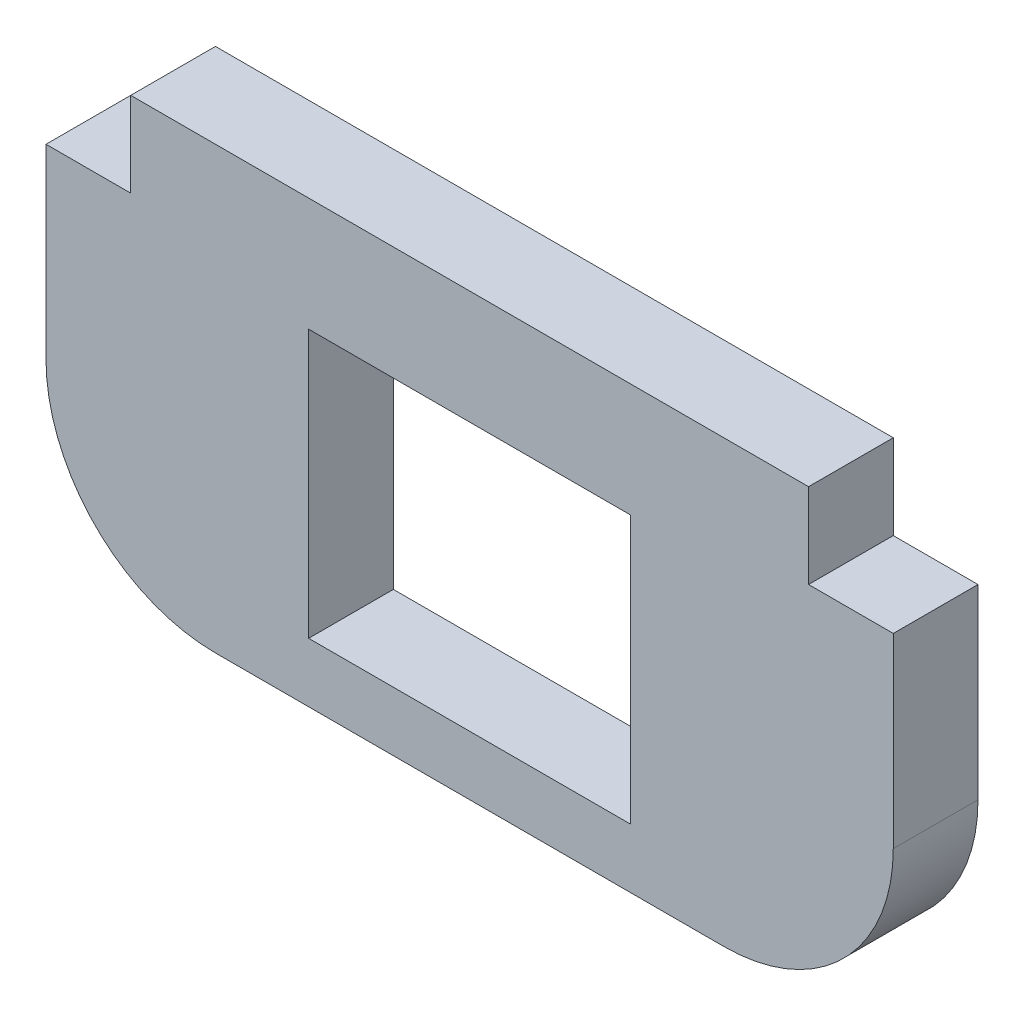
ISO-10303-21;
HEADER;
FILE_DESCRIPTION(('STEP AP214'),'2;1');
FILE_NAME('part.step','',(''),(''),'','','');
FILE_SCHEMA(('AUTOMOTIVE_DESIGN { 1 0 10303 214 1 1 1 1 }'));
ENDSEC;
DATA;
#1=APPLICATION_CONTEXT('core data for automotive mechanical design processes');
#2=APPLICATION_PROTOCOL_DEFINITION('international standard','automotive_design',2000,#1);
#3=PRODUCT_CONTEXT('',#1,'mechanical');
#4=PRODUCT('Part','Part','',(#3));
#5=PRODUCT_RELATED_PRODUCT_CATEGORY('part','',(#4));
#6=PRODUCT_DEFINITION_FORMATION('','',#4);
#7=PRODUCT_DEFINITION_CONTEXT('part definition',#1,'design');
#8=PRODUCT_DEFINITION('design','',#6,#7);
#9=PRODUCT_DEFINITION_SHAPE('','',#8);
#10=(LENGTH_UNIT() NAMED_UNIT(*) SI_UNIT(.MILLI.,.METRE.));
#11=(NAMED_UNIT(*) PLANE_ANGLE_UNIT() SI_UNIT($,.RADIAN.));
#12=(NAMED_UNIT(*) SI_UNIT($,.STERADIAN.) SOLID_ANGLE_UNIT());
#13=UNCERTAINTY_MEASURE_WITH_UNIT(LENGTH_MEASURE(1.E-05),#10,'distance_accuracy_value','');
#14=(GEOMETRIC_REPRESENTATION_CONTEXT(3) GLOBAL_UNCERTAINTY_ASSIGNED_CONTEXT((#13)) GLOBAL_UNIT_ASSIGNED_CONTEXT((#10,
#11,#12)) REPRESENTATION_CONTEXT('',''));
#15=CARTESIAN_POINT('',(0.,0.,0.));
#16=DIRECTION('',(0.,0.,1.));
#17=DIRECTION('',(1.,0.,0.));
#18=AXIS2_PLACEMENT_3D('',#15,#16,#17);
#19=CARTESIAN_POINT('',(15.875,8.255,1.5875));
#20=DIRECTION('',(-1.,0.,0.));
#21=DIRECTION('',(0.,-1.,0.));
#22=AXIS2_PLACEMENT_3D('',#19,#20,#21);
#23=PLANE('',#22);
#24=DIRECTION('',(0.,1.,0.));
#25=VECTOR('',#24,1.);
#26=CARTESIAN_POINT('',(15.875,8.255,1.5875));
#27=LINE('',#26,#25);
#28=CARTESIAN_POINT('',(15.875,-1.905,1.5875));
#29=VERTEX_POINT('',#28);
#30=CARTESIAN_POINT('',(15.875,5.08,1.5875));
#31=VERTEX_POINT('',#30);
#32=EDGE_CURVE('E218',#29,#31,#27,.T.);
#33=ORIENTED_EDGE('',*,*,#32,.F.);
#34=DIRECTION('',(0.,0.,-1.));
#35=VECTOR('',#34,1.);
#36=CARTESIAN_POINT('',(15.875,-1.905,1.5875));
#37=LINE('',#36,#35);
#38=CARTESIAN_POINT('',(15.875,-1.905,-1.5875));
#39=VERTEX_POINT('',#38);
#40=EDGE_CURVE('E227',#29,#39,#37,.T.);
#41=ORIENTED_EDGE('',*,*,#40,.T.);
#42=DIRECTION('',(0.,1.,0.));
#43=VECTOR('',#42,1.);
#44=CARTESIAN_POINT('',(15.875,8.255,-1.5875));
#45=LINE('',#44,#43);
#46=CARTESIAN_POINT('',(15.875,5.08,-1.5875));
#47=VERTEX_POINT('',#46);
#48=EDGE_CURVE('E214',#39,#47,#45,.T.);
#49=ORIENTED_EDGE('',*,*,#48,.T.);
#50=DIRECTION('',(0.,0.,1.));
#51=VECTOR('',#50,1.);
#52=CARTESIAN_POINT('',(15.875,5.08,-1.5875));
#53=LINE('',#52,#51);
#54=EDGE_CURVE('E192',#47,#31,#53,.T.);
#55=ORIENTED_EDGE('',*,*,#54,.T.);
#56=EDGE_LOOP('',(#33,#41,#49,#55));
#57=FACE_BOUND('',#56,.T.);
#58=ADVANCED_FACE('F33',(#57),#23,.F.);
#59=CARTESIAN_POINT('',(-15.875,8.255,1.5875));
#60=DIRECTION('',(0.,-1.,0.));
#61=DIRECTION('',(0.,0.,-1.));
#62=AXIS2_PLACEMENT_3D('',#59,#60,#61);
#63=PLANE('',#62);
#64=DIRECTION('',(-1.,0.,0.));
#65=VECTOR('',#64,1.);
#66=CARTESIAN_POINT('',(-15.875,8.255,1.5875));
#67=LINE('',#66,#65);
#68=CARTESIAN_POINT('',(12.7,8.255,1.5875));
#69=VERTEX_POINT('',#68);
#70=CARTESIAN_POINT('',(-12.7,8.255,1.5875));
#71=VERTEX_POINT('',#70);
#72=EDGE_CURVE('E220',#69,#71,#67,.T.);
#73=ORIENTED_EDGE('',*,*,#72,.F.);
#74=DIRECTION('',(0.,0.,1.));
#75=VECTOR('',#74,1.);
#76=CARTESIAN_POINT('',(12.7,8.255,-1.5875));
#77=LINE('',#76,#75);
#78=CARTESIAN_POINT('',(12.7,8.255,-1.5875));
#79=VERTEX_POINT('',#78);
#80=EDGE_CURVE('E187',#79,#69,#77,.T.);
#81=ORIENTED_EDGE('',*,*,#80,.F.);
#82=DIRECTION('',(-1.,0.,0.));
#83=VECTOR('',#82,1.);
#84=CARTESIAN_POINT('',(-15.875,8.255,-1.5875));
#85=LINE('',#84,#83);
#86=CARTESIAN_POINT('',(-12.7,8.255,-1.5875));
#87=VERTEX_POINT('',#86);
#88=EDGE_CURVE('E229',#79,#87,#85,.T.);
#89=ORIENTED_EDGE('',*,*,#88,.T.);
#90=DIRECTION('',(0.,0.,1.));
#91=VECTOR('',#90,1.);
#92=CARTESIAN_POINT('',(-12.7,8.255,-1.5875));
#93=LINE('',#92,#91);
#94=EDGE_CURVE('E211',#87,#71,#93,.T.);
#95=ORIENTED_EDGE('',*,*,#94,.T.);
#96=EDGE_LOOP('',(#73,#81,#89,#95));
#97=FACE_BOUND('',#96,.T.);
#98=ADVANCED_FACE('F275',(#97),#63,.F.);
#99=CARTESIAN_POINT('',(-15.875,8.255,1.5875));
#100=DIRECTION('',(1.,0.,0.));
#101=DIRECTION('',(0.,0.,-1.));
#102=AXIS2_PLACEMENT_3D('',#99,#100,#101);
#103=PLANE('',#102);
#104=DIRECTION('',(0.,-1.,0.));
#105=VECTOR('',#104,1.);
#106=CARTESIAN_POINT('',(-15.875,8.255,-1.5875));
#107=LINE('',#106,#105);
#108=CARTESIAN_POINT('',(-15.875,5.08,-1.5875));
#109=VERTEX_POINT('',#108);
#110=CARTESIAN_POINT('',(-15.875,-1.905,-1.5875));
#111=VERTEX_POINT('',#110);
#112=EDGE_CURVE('E231',#109,#111,#107,.T.);
#113=ORIENTED_EDGE('',*,*,#112,.T.);
#114=DIRECTION('',(0.,0.,-1.));
#115=VECTOR('',#114,1.);
#116=CARTESIAN_POINT('',(-15.875,-1.905,1.5875));
#117=LINE('',#116,#115);
#118=CARTESIAN_POINT('',(-15.875,-1.905,1.5875));
#119=VERTEX_POINT('',#118);
#120=EDGE_CURVE('E11',#111,#119,#117,.F.);
#121=ORIENTED_EDGE('',*,*,#120,.T.);
#122=DIRECTION('',(0.,-1.,0.));
#123=VECTOR('',#122,1.);
#124=CARTESIAN_POINT('',(-15.875,8.255,1.5875));
#125=LINE('',#124,#123);
#126=CARTESIAN_POINT('',(-15.875,5.08,1.5875));
#127=VERTEX_POINT('',#126);
#128=EDGE_CURVE('E223',#127,#119,#125,.T.);
#129=ORIENTED_EDGE('',*,*,#128,.F.);
#130=DIRECTION('',(0.,0.,1.));
#131=VECTOR('',#130,1.);
#132=CARTESIAN_POINT('',(-15.875,5.08,-1.5875));
#133=LINE('',#132,#131);
#134=EDGE_CURVE('E206',#109,#127,#133,.T.);
#135=ORIENTED_EDGE('',*,*,#134,.F.);
#136=EDGE_LOOP('',(#113,#121,#129,#135));
#137=FACE_BOUND('',#136,.T.);
#138=ADVANCED_FACE('F263',(#137),#103,.F.);
#139=CARTESIAN_POINT('',(-15.875,-8.255,1.5875));
#140=DIRECTION('',(0.,1.,0.));
#141=DIRECTION('',(0.,0.,1.));
#142=AXIS2_PLACEMENT_3D('',#139,#140,#141);
#143=PLANE('',#142);
#144=DIRECTION('',(1.,0.,0.));
#145=VECTOR('',#144,1.);
#146=CARTESIAN_POINT('',(-15.875,-8.255,-1.5875));
#147=LINE('',#146,#145);
#148=CARTESIAN_POINT('',(-9.525,-8.255,-1.5875));
#149=VERTEX_POINT('',#148);
#150=CARTESIAN_POINT('',(9.52500000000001,-8.255,-1.5875));
#151=VERTEX_POINT('',#150);
#152=EDGE_CURVE('E221',#149,#151,#147,.T.);
#153=ORIENTED_EDGE('',*,*,#152,.T.);
#154=DIRECTION('',(0.,0.,-1.));
#155=VECTOR('',#154,1.);
#156=CARTESIAN_POINT('',(9.52500000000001,-8.255,1.5875));
#157=LINE('',#156,#155);
#158=CARTESIAN_POINT('',(9.52500000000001,-8.255,1.5875));
#159=VERTEX_POINT('',#158);
#160=EDGE_CURVE('E54',#151,#159,#157,.F.);
#161=ORIENTED_EDGE('',*,*,#160,.T.);
#162=DIRECTION('',(1.,0.,0.));
#163=VECTOR('',#162,1.);
#164=CARTESIAN_POINT('',(-15.875,-8.255,1.5875));
#165=LINE('',#164,#163);
#166=CARTESIAN_POINT('',(-9.525,-8.255,1.5875));
#167=VERTEX_POINT('',#166);
#168=EDGE_CURVE('E225',#167,#159,#165,.T.);
#169=ORIENTED_EDGE('',*,*,#168,.F.);
#170=DIRECTION('',(0.,0.,-1.));
#171=VECTOR('',#170,1.);
#172=CARTESIAN_POINT('',(-9.525,-8.255,1.5875));
#173=LINE('',#172,#171);
#174=EDGE_CURVE('E240',#167,#149,#173,.T.);
#175=ORIENTED_EDGE('',*,*,#174,.T.);
#176=EDGE_LOOP('',(#153,#161,#169,#175));
#177=FACE_BOUND('',#176,.T.);
#178=ADVANCED_FACE('F257',(#177),#143,.F.);
#179=CARTESIAN_POINT('',(15.875,-8.255,1.5875));
#180=DIRECTION('',(0.,0.,1.));
#181=DIRECTION('',(1.,0.,0.));
#182=AXIS2_PLACEMENT_3D('',#179,#180,#181);
#183=PLANE('',#182);
#184=DIRECTION('',(0.,1.,0.));
#185=VECTOR('',#184,1.);
#186=CARTESIAN_POINT('',(6.0325,4.0005,1.5875));
#187=LINE('',#186,#185);
#188=CARTESIAN_POINT('',(6.0325,-6.0325,1.5875));
#189=VERTEX_POINT('',#188);
#190=CARTESIAN_POINT('',(6.0325,4.0005,1.5875));
#191=VERTEX_POINT('',#190);
#192=EDGE_CURVE('E143',#189,#191,#187,.T.);
#193=ORIENTED_EDGE('',*,*,#192,.F.);
#194=DIRECTION('',(1.,0.,0.));
#195=VECTOR('',#194,1.);
#196=CARTESIAN_POINT('',(-6.0325,-6.0325,1.5875));
#197=LINE('',#196,#195);
#198=CARTESIAN_POINT('',(-6.0325,-6.0325,1.5875));
#199=VERTEX_POINT('',#198);
#200=EDGE_CURVE('E161',#199,#189,#197,.T.);
#201=ORIENTED_EDGE('',*,*,#200,.F.);
#202=DIRECTION('',(0.,-1.,0.));
#203=VECTOR('',#202,1.);
#204=CARTESIAN_POINT('',(-6.0325,4.0005,1.5875));
#205=LINE('',#204,#203);
#206=CARTESIAN_POINT('',(-6.0325,4.0005,1.5875));
#207=VERTEX_POINT('',#206);
#208=EDGE_CURVE('E164',#207,#199,#205,.T.);
#209=ORIENTED_EDGE('',*,*,#208,.F.);
#210=DIRECTION('',(-1.,0.,0.));
#211=VECTOR('',#210,1.);
#212=CARTESIAN_POINT('',(-6.0325,4.0005,1.5875));
#213=LINE('',#212,#211);
#214=EDGE_CURVE('E170',#191,#207,#213,.T.);
#215=ORIENTED_EDGE('',*,*,#214,.F.);
#216=EDGE_LOOP('',(#193,#201,#209,#215));
#217=FACE_BOUND('',#216,.T.);
#218=ORIENTED_EDGE('',*,*,#168,.T.);
#219=CARTESIAN_POINT('',(9.52500000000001,-1.905,1.5875));
#220=DIRECTION('',(0.,0.,1.));
#221=DIRECTION('',(1.,0.,0.));
#222=AXIS2_PLACEMENT_3D('',#219,#220,#221);
#223=CIRCLE('',#222,6.35);
#224=EDGE_CURVE('E41',#159,#29,#223,.T.);
#225=ORIENTED_EDGE('',*,*,#224,.T.);
#226=ORIENTED_EDGE('',*,*,#32,.T.);
#227=DIRECTION('',(1.,0.,0.));
#228=VECTOR('',#227,1.);
#229=CARTESIAN_POINT('',(15.875,5.08,1.5875));
#230=LINE('',#229,#228);
#231=CARTESIAN_POINT('',(12.7,5.08,1.5875));
#232=VERTEX_POINT('',#231);
#233=EDGE_CURVE('E184',#232,#31,#230,.T.);
#234=ORIENTED_EDGE('',*,*,#233,.F.);
#235=DIRECTION('',(0.,-1.,0.));
#236=VECTOR('',#235,1.);
#237=CARTESIAN_POINT('',(12.7,8.255,1.5875));
#238=LINE('',#237,#236);
#239=EDGE_CURVE('E176',#69,#232,#238,.T.);
#240=ORIENTED_EDGE('',*,*,#239,.F.);
#241=ORIENTED_EDGE('',*,*,#72,.T.);
#242=DIRECTION('',(0.,1.,0.));
#243=VECTOR('',#242,1.);
#244=CARTESIAN_POINT('',(-12.7,8.255,1.5875));
#245=LINE('',#244,#243);
#246=CARTESIAN_POINT('',(-12.7,5.08,1.5875));
#247=VERTEX_POINT('',#246);
#248=EDGE_CURVE('E203',#247,#71,#245,.T.);
#249=ORIENTED_EDGE('',*,*,#248,.F.);
#250=DIRECTION('',(1.,0.,0.));
#251=VECTOR('',#250,1.);
#252=CARTESIAN_POINT('',(-15.875,5.08,1.5875));
#253=LINE('',#252,#251);
#254=EDGE_CURVE('E195',#127,#247,#253,.T.);
#255=ORIENTED_EDGE('',*,*,#254,.F.);
#256=ORIENTED_EDGE('',*,*,#128,.T.);
#257=CARTESIAN_POINT('',(-9.525,-1.905,1.5875));
#258=DIRECTION('',(0.,0.,1.));
#259=DIRECTION('',(1.,0.,0.));
#260=AXIS2_PLACEMENT_3D('',#257,#258,#259);
#261=CIRCLE('',#260,6.35);
#262=EDGE_CURVE('E244',#119,#167,#261,.T.);
#263=ORIENTED_EDGE('',*,*,#262,.T.);
#264=EDGE_LOOP('',(#218,#225,#226,#234,#240,#241,#249,#255,#256,#263));
#265=FACE_BOUND('',#264,.T.);
#266=ADVANCED_FACE('F248',(#217,#265),#183,.T.);
#267=CARTESIAN_POINT('',(15.875,-8.255,-1.5875));
#268=DIRECTION('',(0.,0.,1.));
#269=DIRECTION('',(1.,0.,0.));
#270=AXIS2_PLACEMENT_3D('',#267,#268,#269);
#271=PLANE('',#270);
#272=DIRECTION('',(1.,0.,0.));
#273=VECTOR('',#272,1.);
#274=CARTESIAN_POINT('',(-6.0325,-6.0325,-1.5875));
#275=LINE('',#274,#273);
#276=CARTESIAN_POINT('',(-6.0325,-6.0325,-1.5875));
#277=VERTEX_POINT('',#276);
#278=CARTESIAN_POINT('',(6.0325,-6.0325,-1.5875));
#279=VERTEX_POINT('',#278);
#280=EDGE_CURVE('E148',#277,#279,#275,.T.);
#281=ORIENTED_EDGE('',*,*,#280,.T.);
#282=DIRECTION('',(0.,1.,0.));
#283=VECTOR('',#282,1.);
#284=CARTESIAN_POINT('',(6.0325,4.0005,-1.5875));
#285=LINE('',#284,#283);
#286=CARTESIAN_POINT('',(6.0325,4.0005,-1.5875));
#287=VERTEX_POINT('',#286);
#288=EDGE_CURVE('E140',#279,#287,#285,.T.);
#289=ORIENTED_EDGE('',*,*,#288,.T.);
#290=DIRECTION('',(-1.,0.,0.));
#291=VECTOR('',#290,1.);
#292=CARTESIAN_POINT('',(-6.0325,4.0005,-1.5875));
#293=LINE('',#292,#291);
#294=CARTESIAN_POINT('',(-6.0325,4.0005,-1.5875));
#295=VERTEX_POINT('',#294);
#296=EDGE_CURVE('E152',#287,#295,#293,.T.);
#297=ORIENTED_EDGE('',*,*,#296,.T.);
#298=DIRECTION('',(0.,-1.,0.));
#299=VECTOR('',#298,1.);
#300=CARTESIAN_POINT('',(-6.0325,4.0005,-1.5875));
#301=LINE('',#300,#299);
#302=EDGE_CURVE('E156',#295,#277,#301,.T.);
#303=ORIENTED_EDGE('',*,*,#302,.T.);
#304=EDGE_LOOP('',(#281,#289,#297,#303));
#305=FACE_BOUND('',#304,.T.);
#306=ORIENTED_EDGE('',*,*,#48,.F.);
#307=CARTESIAN_POINT('',(9.52500000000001,-1.905,-1.5875));
#308=DIRECTION('',(0.,0.,1.));
#309=DIRECTION('',(1.,0.,0.));
#310=AXIS2_PLACEMENT_3D('',#307,#308,#309);
#311=CIRCLE('',#310,6.35);
#312=EDGE_CURVE('E238',#39,#151,#311,.F.);
#313=ORIENTED_EDGE('',*,*,#312,.T.);
#314=ORIENTED_EDGE('',*,*,#152,.F.);
#315=CARTESIAN_POINT('',(-9.525,-1.905,-1.5875));
#316=DIRECTION('',(0.,0.,1.));
#317=DIRECTION('',(1.,0.,0.));
#318=AXIS2_PLACEMENT_3D('',#315,#316,#317);
#319=CIRCLE('',#318,6.35);
#320=EDGE_CURVE('E236',#149,#111,#319,.F.);
#321=ORIENTED_EDGE('',*,*,#320,.T.);
#322=ORIENTED_EDGE('',*,*,#112,.F.);
#323=DIRECTION('',(1.,0.,0.));
#324=VECTOR('',#323,1.);
#325=CARTESIAN_POINT('',(-15.875,5.08,-1.5875));
#326=LINE('',#325,#324);
#327=CARTESIAN_POINT('',(-12.7,5.08,-1.5875));
#328=VERTEX_POINT('',#327);
#329=EDGE_CURVE('E199',#109,#328,#326,.T.);
#330=ORIENTED_EDGE('',*,*,#329,.T.);
#331=DIRECTION('',(0.,1.,0.));
#332=VECTOR('',#331,1.);
#333=CARTESIAN_POINT('',(-12.7,8.255,-1.5875));
#334=LINE('',#333,#332);
#335=EDGE_CURVE('E202',#328,#87,#334,.T.);
#336=ORIENTED_EDGE('',*,*,#335,.T.);
#337=ORIENTED_EDGE('',*,*,#88,.F.);
#338=DIRECTION('',(0.,-1.,0.));
#339=VECTOR('',#338,1.);
#340=CARTESIAN_POINT('',(12.7,8.255,-1.5875));
#341=LINE('',#340,#339);
#342=CARTESIAN_POINT('',(12.7,5.08,-1.5875));
#343=VERTEX_POINT('',#342);
#344=EDGE_CURVE('E180',#79,#343,#341,.T.);
#345=ORIENTED_EDGE('',*,*,#344,.T.);
#346=DIRECTION('',(1.,0.,0.));
#347=VECTOR('',#346,1.);
#348=CARTESIAN_POINT('',(15.875,5.08,-1.5875));
#349=LINE('',#348,#347);
#350=EDGE_CURVE('E183',#343,#47,#349,.T.);
#351=ORIENTED_EDGE('',*,*,#350,.T.);
#352=EDGE_LOOP('',(#306,#313,#314,#321,#322,#330,#336,#337,#345,#351));
#353=FACE_BOUND('',#352,.T.);
#354=ADVANCED_FACE('F158',(#305,#353),#271,.F.);
#355=CARTESIAN_POINT('',(-12.7,8.255,-1.5875));
#356=DIRECTION('',(1.,0.,0.));
#357=DIRECTION('',(0.,0.,-1.));
#358=AXIS2_PLACEMENT_3D('',#355,#356,#357);
#359=PLANE('',#358);
#360=ORIENTED_EDGE('',*,*,#248,.T.);
#361=ORIENTED_EDGE('',*,*,#94,.F.);
#362=ORIENTED_EDGE('',*,*,#335,.F.);
#363=DIRECTION('',(0.,0.,1.));
#364=VECTOR('',#363,1.);
#365=CARTESIAN_POINT('',(-12.7,5.08,-1.5875));
#366=LINE('',#365,#364);
#367=EDGE_CURVE('E215',#328,#247,#366,.T.);
#368=ORIENTED_EDGE('',*,*,#367,.T.);
#369=EDGE_LOOP('',(#360,#361,#362,#368));
#370=FACE_BOUND('',#369,.T.);
#371=ADVANCED_FACE('F273',(#370),#359,.F.);
#372=CARTESIAN_POINT('',(-15.875,5.08,-1.5875));
#373=DIRECTION('',(0.,-1.,0.));
#374=DIRECTION('',(0.,0.,-1.));
#375=AXIS2_PLACEMENT_3D('',#372,#373,#374);
#376=PLANE('',#375);
#377=ORIENTED_EDGE('',*,*,#254,.T.);
#378=ORIENTED_EDGE('',*,*,#367,.F.);
#379=ORIENTED_EDGE('',*,*,#329,.F.);
#380=ORIENTED_EDGE('',*,*,#134,.T.);
#381=EDGE_LOOP('',(#377,#378,#379,#380));
#382=FACE_BOUND('',#381,.T.);
#383=ADVANCED_FACE('F266',(#382),#376,.F.);
#384=CARTESIAN_POINT('',(15.875,5.08,-1.5875));
#385=DIRECTION('',(0.,-1.,0.));
#386=DIRECTION('',(0.,0.,-1.));
#387=AXIS2_PLACEMENT_3D('',#384,#385,#386);
#388=PLANE('',#387);
#389=ORIENTED_EDGE('',*,*,#233,.T.);
#390=ORIENTED_EDGE('',*,*,#54,.F.);
#391=ORIENTED_EDGE('',*,*,#350,.F.);
#392=DIRECTION('',(0.,0.,1.));
#393=VECTOR('',#392,1.);
#394=CARTESIAN_POINT('',(12.7,5.08,-1.5875));
#395=LINE('',#394,#393);
#396=EDGE_CURVE('E196',#343,#232,#395,.T.);
#397=ORIENTED_EDGE('',*,*,#396,.T.);
#398=EDGE_LOOP('',(#389,#390,#391,#397));
#399=FACE_BOUND('',#398,.T.);
#400=ADVANCED_FACE('F282',(#399),#388,.F.);
#401=CARTESIAN_POINT('',(12.7,8.255,-1.5875));
#402=DIRECTION('',(-1.,0.,0.));
#403=DIRECTION('',(0.,-1.,0.));
#404=AXIS2_PLACEMENT_3D('',#401,#402,#403);
#405=PLANE('',#404);
#406=ORIENTED_EDGE('',*,*,#239,.T.);
#407=ORIENTED_EDGE('',*,*,#396,.F.);
#408=ORIENTED_EDGE('',*,*,#344,.F.);
#409=ORIENTED_EDGE('',*,*,#80,.T.);
#410=EDGE_LOOP('',(#406,#407,#408,#409));
#411=FACE_BOUND('',#410,.T.);
#412=ADVANCED_FACE('F280',(#411),#405,.F.);
#413=CARTESIAN_POINT('',(6.0325,4.0005,-1.5875));
#414=DIRECTION('',(1.,0.,0.));
#415=DIRECTION('',(0.,1.,0.));
#416=AXIS2_PLACEMENT_3D('',#413,#414,#415);
#417=PLANE('',#416);
#418=ORIENTED_EDGE('',*,*,#192,.T.);
#419=DIRECTION('',(0.,0.,1.));
#420=VECTOR('',#419,1.);
#421=CARTESIAN_POINT('',(6.0325,4.0005,-1.5875));
#422=LINE('',#421,#420);
#423=EDGE_CURVE('E136',#287,#191,#422,.T.);
#424=ORIENTED_EDGE('',*,*,#423,.F.);
#425=ORIENTED_EDGE('',*,*,#288,.F.);
#426=DIRECTION('',(0.,0.,1.));
#427=VECTOR('',#426,1.);
#428=CARTESIAN_POINT('',(6.0325,-6.0325,-1.5875));
#429=LINE('',#428,#427);
#430=EDGE_CURVE('E174',#279,#189,#429,.T.);
#431=ORIENTED_EDGE('',*,*,#430,.T.);
#432=EDGE_LOOP('',(#418,#424,#425,#431));
#433=FACE_BOUND('',#432,.T.);
#434=ADVANCED_FACE('F138',(#433),#417,.F.);
#435=CARTESIAN_POINT('',(-6.0325,-6.0325,-1.5875));
#436=DIRECTION('',(0.,-1.,0.));
#437=DIRECTION('',(0.,0.,-1.));
#438=AXIS2_PLACEMENT_3D('',#435,#436,#437);
#439=PLANE('',#438);
#440=ORIENTED_EDGE('',*,*,#200,.T.);
#441=ORIENTED_EDGE('',*,*,#430,.F.);
#442=ORIENTED_EDGE('',*,*,#280,.F.);
#443=DIRECTION('',(0.,0.,1.));
#444=VECTOR('',#443,1.);
#445=CARTESIAN_POINT('',(-6.0325,-6.0325,-1.5875));
#446=LINE('',#445,#444);
#447=EDGE_CURVE('E177',#277,#199,#446,.T.);
#448=ORIENTED_EDGE('',*,*,#447,.T.);
#449=EDGE_LOOP('',(#440,#441,#442,#448));
#450=FACE_BOUND('',#449,.T.);
#451=ADVANCED_FACE('F310',(#450),#439,.F.);
#452=CARTESIAN_POINT('',(-6.0325,4.0005,-1.5875));
#453=DIRECTION('',(-1.,0.,0.));
#454=DIRECTION('',(0.,-1.,0.));
#455=AXIS2_PLACEMENT_3D('',#452,#453,#454);
#456=PLANE('',#455);
#457=ORIENTED_EDGE('',*,*,#208,.T.);
#458=ORIENTED_EDGE('',*,*,#447,.F.);
#459=ORIENTED_EDGE('',*,*,#302,.F.);
#460=DIRECTION('',(0.,0.,1.));
#461=VECTOR('',#460,1.);
#462=CARTESIAN_POINT('',(-6.0325,4.0005,-1.5875));
#463=LINE('',#462,#461);
#464=EDGE_CURVE('E147',#295,#207,#463,.T.);
#465=ORIENTED_EDGE('',*,*,#464,.T.);
#466=EDGE_LOOP('',(#457,#458,#459,#465));
#467=FACE_BOUND('',#466,.T.);
#468=ADVANCED_FACE('F306',(#467),#456,.F.);
#469=CARTESIAN_POINT('',(-6.0325,4.0005,-1.5875));
#470=DIRECTION('',(0.,1.,0.));
#471=DIRECTION('',(0.,0.,1.));
#472=AXIS2_PLACEMENT_3D('',#469,#470,#471);
#473=PLANE('',#472);
#474=ORIENTED_EDGE('',*,*,#214,.T.);
#475=ORIENTED_EDGE('',*,*,#464,.F.);
#476=ORIENTED_EDGE('',*,*,#296,.F.);
#477=ORIENTED_EDGE('',*,*,#423,.T.);
#478=EDGE_LOOP('',(#474,#475,#476,#477));
#479=FACE_BOUND('',#478,.T.);
#480=ADVANCED_FACE('F153',(#479),#473,.F.);
#481=CARTESIAN_POINT('',(9.52500000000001,-1.905,1.5875));
#482=DIRECTION('',(0.,0.,-1.));
#483=DIRECTION('',(-1.,0.,0.));
#484=AXIS2_PLACEMENT_3D('',#481,#482,#483);
#485=CYLINDRICAL_SURFACE('',#484,6.35);
#486=ORIENTED_EDGE('',*,*,#224,.F.);
#487=ORIENTED_EDGE('',*,*,#160,.F.);
#488=ORIENTED_EDGE('',*,*,#312,.F.);
#489=ORIENTED_EDGE('',*,*,#40,.F.);
#490=EDGE_LOOP('',(#486,#487,#488,#489));
#491=FACE_BOUND('',#490,.T.);
#492=ADVANCED_FACE('F255',(#491),#485,.T.);
#493=CARTESIAN_POINT('',(-9.525,-1.905,1.5875));
#494=DIRECTION('',(0.,0.,-1.));
#495=DIRECTION('',(-1.,0.,0.));
#496=AXIS2_PLACEMENT_3D('',#493,#494,#495);
#497=CYLINDRICAL_SURFACE('',#496,6.35);
#498=ORIENTED_EDGE('',*,*,#262,.F.);
#499=ORIENTED_EDGE('',*,*,#120,.F.);
#500=ORIENTED_EDGE('',*,*,#320,.F.);
#501=ORIENTED_EDGE('',*,*,#174,.F.);
#502=EDGE_LOOP('',(#498,#499,#500,#501));
#503=FACE_BOUND('',#502,.T.);
#504=ADVANCED_FACE('F35',(#503),#497,.T.);
#505=CLOSED_SHELL('',(#58,#98,#138,#178,#266,#354,#371,#383,#400,#412,#434,#451,#468,#480,#492,#504));
#506=MANIFOLD_SOLID_BREP('B2',#505);
#507=ADVANCED_BREP_SHAPE_REPRESENTATION('',(#18,#506),#14);
#508=SHAPE_DEFINITION_REPRESENTATION(#9,#507);
ENDSEC;
END-ISO-10303-21;
